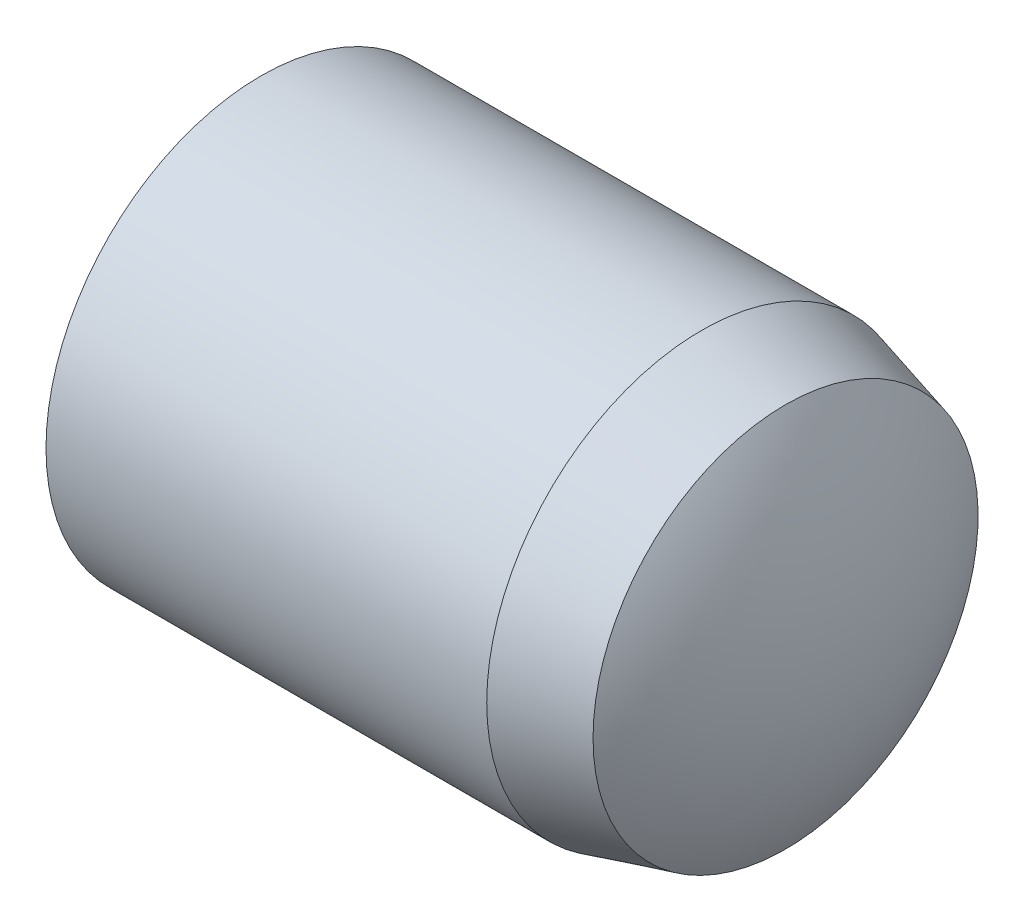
from build123d import *

# Parameters (mm, degrees)
EXTRUDE1_DEPTH      = 6
EXTRUDE1_DEPTH_BACK = 6
SKETCH2_R           = 4


with BuildPart() as part:
    # Sketch2 → Extrude1 (new, two sides: drawn at the far end of the back side and taken through both)
    with BuildSketch(Plane(origin=(0, 0, 0), x_dir=(0, 0, -1), z_dir=(1, 0, 0)).offset(-EXTRUDE1_DEPTH_BACK)):
        Circle(SKETCH2_R)
    extrude(amount=EXTRUDE1_DEPTH + EXTRUDE1_DEPTH_BACK)

    # Sketch5 → Cut-Revolve1 (revolve, cut)
    with BuildSketch(Plane.XY, mode=Mode.PRIVATE) as cut_revolve1_sk:
        with BuildLine():
            Line((3.4, 4), (3.4, 4.5))
            Line((3.4, 4.5), (6.5, 4.5))
            Line((6.5, 4.5), (6.5, 0))
            Line((6.5, 0), (6, 0))
            ThreePointArc((6, 0), (5.734740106, 1.864961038), (4.96, 3.58199926))
            Line((4.96, 3.58199926), (3.4, 4))
        make_face()
        with BuildLine():
            Line((-4.8, 4), (-4.8, 4.5))
            Line((-4.8, 4.5), (-6.5, 4.5))
            Line((-6.5, 4.5), (-6.5, 0))
            Line((-6.5, 0), (-6, 0))
            ThreePointArc((-6, 0), (-5.693537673, 2.088061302), (-4.8, 4))
        make_face()
    revolve(cut_revolve1_sk.sketch.rotate(Axis((-6, 0, 0), (1, 0, 0)), 90), axis=Axis((-6, 0, 0), (1, 0, 0)), mode=Mode.SUBTRACT)


solid = part.part
